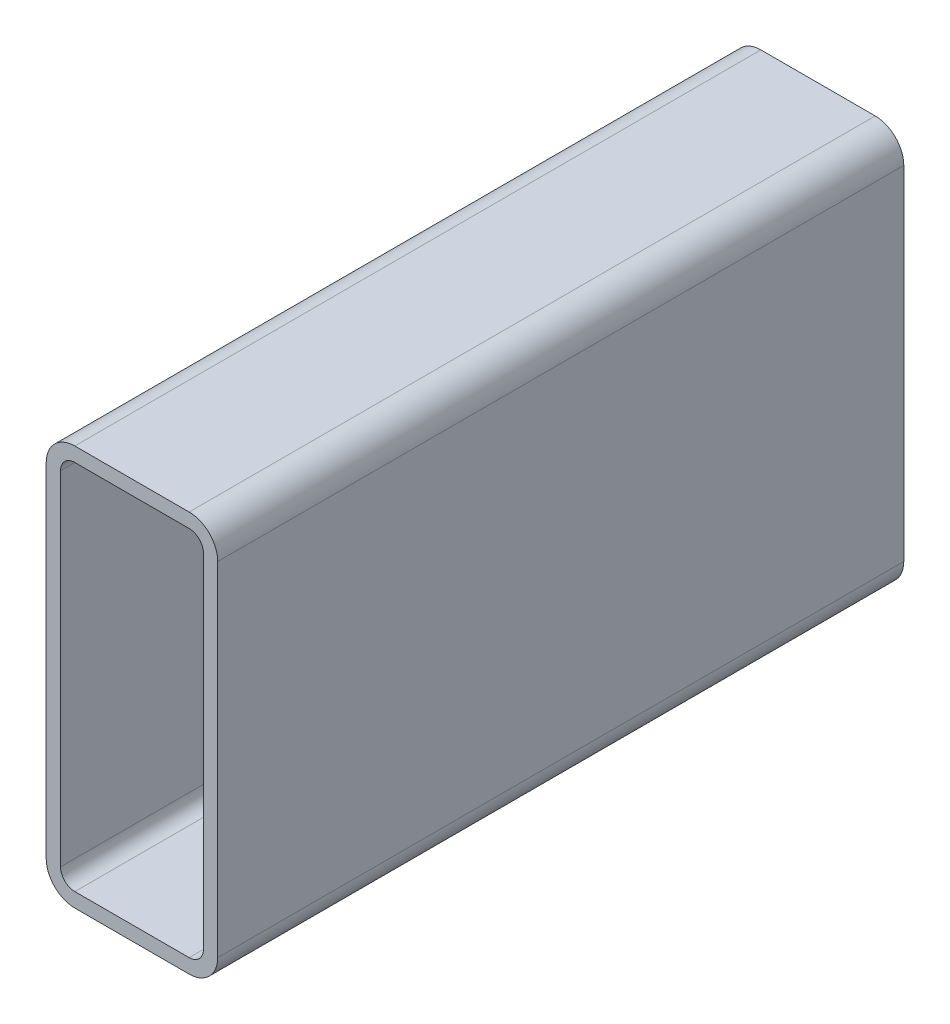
ISO-10303-21;
HEADER;
FILE_DESCRIPTION(('STEP AP214'),'2;1');
FILE_NAME('part.step','',(''),(''),'','','');
FILE_SCHEMA(('AUTOMOTIVE_DESIGN { 1 0 10303 214 1 1 1 1 }'));
ENDSEC;
DATA;
#1=APPLICATION_CONTEXT('core data for automotive mechanical design processes');
#2=APPLICATION_PROTOCOL_DEFINITION('international standard','automotive_design',2000,#1);
#3=PRODUCT_CONTEXT('',#1,'mechanical');
#4=PRODUCT('Part','Part','',(#3));
#5=PRODUCT_RELATED_PRODUCT_CATEGORY('part','',(#4));
#6=PRODUCT_DEFINITION_FORMATION('','',#4);
#7=PRODUCT_DEFINITION_CONTEXT('part definition',#1,'design');
#8=PRODUCT_DEFINITION('design','',#6,#7);
#9=PRODUCT_DEFINITION_SHAPE('','',#8);
#10=(LENGTH_UNIT() NAMED_UNIT(*) SI_UNIT(.MILLI.,.METRE.));
#11=(NAMED_UNIT(*) PLANE_ANGLE_UNIT() SI_UNIT($,.RADIAN.));
#12=(NAMED_UNIT(*) SI_UNIT($,.STERADIAN.) SOLID_ANGLE_UNIT());
#13=UNCERTAINTY_MEASURE_WITH_UNIT(LENGTH_MEASURE(1.E-05),#10,'distance_accuracy_value','');
#14=(GEOMETRIC_REPRESENTATION_CONTEXT(3) GLOBAL_UNCERTAINTY_ASSIGNED_CONTEXT((#13)) GLOBAL_UNIT_ASSIGNED_CONTEXT((#10,
#11,#12)) REPRESENTATION_CONTEXT('',''));
#15=CARTESIAN_POINT('',(0.,0.,0.));
#16=DIRECTION('',(0.,0.,1.));
#17=DIRECTION('',(1.,0.,0.));
#18=AXIS2_PLACEMENT_3D('',#15,#16,#17);
#19=CARTESIAN_POINT('',(15.1891160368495,167.089039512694,304.8));
#20=DIRECTION('',(0.,0.,1.));
#21=DIRECTION('',(1.,0.,0.));
#22=AXIS2_PLACEMENT_3D('',#19,#20,#21);
#23=PLANE('',#22);
#24=CARTESIAN_POINT('',(15.1891160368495,167.089039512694,304.8));
#25=DIRECTION('',(0.,0.,1.));
#26=DIRECTION('',(1.,0.,0.));
#27=AXIS2_PLACEMENT_3D('',#24,#25,#26);
#28=CIRCLE('',#27,12.7);
#29=CARTESIAN_POINT('',(15.1891160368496,179.789039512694,304.8));
#30=VERTEX_POINT('',#29);
#31=CARTESIAN_POINT('',(2.48911603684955,167.089039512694,304.8));
#32=VERTEX_POINT('',#31);
#33=EDGE_CURVE('E211',#30,#32,#28,.T.);
#34=ORIENTED_EDGE('',*,*,#33,.T.);
#35=DIRECTION('',(0.,-1.,0.));
#36=VECTOR('',#35,1.);
#37=CARTESIAN_POINT('',(2.48911603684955,14.6890395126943,304.8));
#38=LINE('',#37,#36);
#39=CARTESIAN_POINT('',(2.48911603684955,14.6890395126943,304.8));
#40=VERTEX_POINT('',#39);
#41=EDGE_CURVE('E214',#32,#40,#38,.T.);
#42=ORIENTED_EDGE('',*,*,#41,.T.);
#43=CARTESIAN_POINT('',(15.1891160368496,14.6890395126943,304.8));
#44=DIRECTION('',(0.,0.,1.));
#45=DIRECTION('',(1.,0.,0.));
#46=AXIS2_PLACEMENT_3D('',#43,#44,#45);
#47=CIRCLE('',#46,12.7);
#48=CARTESIAN_POINT('',(15.1891160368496,1.98903951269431,304.8));
#49=VERTEX_POINT('',#48);
#50=EDGE_CURVE('E217',#40,#49,#47,.T.);
#51=ORIENTED_EDGE('',*,*,#50,.T.);
#52=DIRECTION('',(1.,0.,0.));
#53=VECTOR('',#52,1.);
#54=CARTESIAN_POINT('',(65.9891160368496,1.98903951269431,304.8));
#55=LINE('',#54,#53);
#56=CARTESIAN_POINT('',(65.9891160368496,1.98903951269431,304.8));
#57=VERTEX_POINT('',#56);
#58=EDGE_CURVE('E219',#49,#57,#55,.T.);
#59=ORIENTED_EDGE('',*,*,#58,.T.);
#60=CARTESIAN_POINT('',(65.9891160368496,14.6890395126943,304.8));
#61=DIRECTION('',(0.,0.,1.));
#62=DIRECTION('',(1.,0.,0.));
#63=AXIS2_PLACEMENT_3D('',#60,#61,#62);
#64=CIRCLE('',#63,12.7);
#65=CARTESIAN_POINT('',(78.6891160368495,14.6890395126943,304.8));
#66=VERTEX_POINT('',#65);
#67=EDGE_CURVE('E221',#57,#66,#64,.T.);
#68=ORIENTED_EDGE('',*,*,#67,.T.);
#69=DIRECTION('',(0.,1.,0.));
#70=VECTOR('',#69,1.);
#71=CARTESIAN_POINT('',(78.6891160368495,167.089039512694,304.8));
#72=LINE('',#71,#70);
#73=CARTESIAN_POINT('',(78.6891160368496,167.089039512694,304.8));
#74=VERTEX_POINT('',#73);
#75=EDGE_CURVE('E223',#66,#74,#72,.T.);
#76=ORIENTED_EDGE('',*,*,#75,.T.);
#77=CARTESIAN_POINT('',(65.9891160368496,167.089039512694,304.8));
#78=DIRECTION('',(0.,0.,1.));
#79=DIRECTION('',(1.,0.,0.));
#80=AXIS2_PLACEMENT_3D('',#77,#78,#79);
#81=CIRCLE('',#80,12.7);
#82=CARTESIAN_POINT('',(65.9891160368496,179.789039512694,304.8));
#83=VERTEX_POINT('',#82);
#84=EDGE_CURVE('E225',#74,#83,#81,.T.);
#85=ORIENTED_EDGE('',*,*,#84,.T.);
#86=DIRECTION('',(-1.,0.,0.));
#87=VECTOR('',#86,1.);
#88=CARTESIAN_POINT('',(15.1891160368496,179.789039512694,304.8));
#89=LINE('',#88,#87);
#90=EDGE_CURVE('E227',#83,#30,#89,.T.);
#91=ORIENTED_EDGE('',*,*,#90,.T.);
#92=EDGE_LOOP('',(#34,#42,#51,#59,#68,#76,#85,#91));
#93=FACE_BOUND('',#92,.T.);
#94=DIRECTION('',(0.,-1.,0.));
#95=VECTOR('',#94,1.);
#96=CARTESIAN_POINT('',(8.83911603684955,14.6890395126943,304.8));
#97=LINE('',#96,#95);
#98=CARTESIAN_POINT('',(8.83911603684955,167.089039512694,304.8));
#99=VERTEX_POINT('',#98);
#100=CARTESIAN_POINT('',(8.83911603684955,14.6890395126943,304.8));
#101=VERTEX_POINT('',#100);
#102=EDGE_CURVE('E154',#99,#101,#97,.T.);
#103=ORIENTED_EDGE('',*,*,#102,.F.);
#104=CARTESIAN_POINT('',(15.1891160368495,167.089039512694,304.8));
#105=DIRECTION('',(0.,0.,1.));
#106=DIRECTION('',(1.,0.,0.));
#107=AXIS2_PLACEMENT_3D('',#104,#105,#106);
#108=CIRCLE('',#107,6.35);
#109=CARTESIAN_POINT('',(15.1891160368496,173.439039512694,304.8));
#110=VERTEX_POINT('',#109);
#111=EDGE_CURVE('E146',#110,#99,#108,.T.);
#112=ORIENTED_EDGE('',*,*,#111,.F.);
#113=DIRECTION('',(-1.,0.,0.));
#114=VECTOR('',#113,1.);
#115=CARTESIAN_POINT('',(15.1891160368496,173.439039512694,304.8));
#116=LINE('',#115,#114);
#117=CARTESIAN_POINT('',(65.9891160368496,173.439039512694,304.8));
#118=VERTEX_POINT('',#117);
#119=EDGE_CURVE('E179',#118,#110,#116,.T.);
#120=ORIENTED_EDGE('',*,*,#119,.F.);
#121=CARTESIAN_POINT('',(65.9891160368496,167.089039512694,304.8));
#122=DIRECTION('',(0.,0.,1.));
#123=DIRECTION('',(1.,0.,0.));
#124=AXIS2_PLACEMENT_3D('',#121,#122,#123);
#125=CIRCLE('',#124,6.34999999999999);
#126=CARTESIAN_POINT('',(72.3391160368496,167.089039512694,304.8));
#127=VERTEX_POINT('',#126);
#128=EDGE_CURVE('E177',#127,#118,#125,.T.);
#129=ORIENTED_EDGE('',*,*,#128,.F.);
#130=DIRECTION('',(0.,1.,0.));
#131=VECTOR('',#130,1.);
#132=CARTESIAN_POINT('',(72.3391160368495,167.089039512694,304.8));
#133=LINE('',#132,#131);
#134=CARTESIAN_POINT('',(72.3391160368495,14.6890395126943,304.8));
#135=VERTEX_POINT('',#134);
#136=EDGE_CURVE('E175',#135,#127,#133,.T.);
#137=ORIENTED_EDGE('',*,*,#136,.F.);
#138=CARTESIAN_POINT('',(65.9891160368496,14.6890395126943,304.8));
#139=DIRECTION('',(0.,0.,1.));
#140=DIRECTION('',(1.,0.,0.));
#141=AXIS2_PLACEMENT_3D('',#138,#139,#140);
#142=CIRCLE('',#141,6.35);
#143=CARTESIAN_POINT('',(65.9891160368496,8.33903951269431,304.8));
#144=VERTEX_POINT('',#143);
#145=EDGE_CURVE('E173',#144,#135,#142,.T.);
#146=ORIENTED_EDGE('',*,*,#145,.F.);
#147=DIRECTION('',(1.,0.,0.));
#148=VECTOR('',#147,1.);
#149=CARTESIAN_POINT('',(65.9891160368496,8.33903951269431,304.8));
#150=LINE('',#149,#148);
#151=CARTESIAN_POINT('',(15.1891160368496,8.33903951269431,304.8));
#152=VERTEX_POINT('',#151);
#153=EDGE_CURVE('E169',#152,#144,#150,.T.);
#154=ORIENTED_EDGE('',*,*,#153,.F.);
#155=CARTESIAN_POINT('',(15.1891160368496,14.6890395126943,304.8));
#156=DIRECTION('',(0.,0.,1.));
#157=DIRECTION('',(1.,0.,0.));
#158=AXIS2_PLACEMENT_3D('',#155,#156,#157);
#159=CIRCLE('',#158,6.35);
#160=EDGE_CURVE('E167',#101,#152,#159,.T.);
#161=ORIENTED_EDGE('',*,*,#160,.F.);
#162=EDGE_LOOP('',(#103,#112,#120,#129,#137,#146,#154,#161));
#163=FACE_BOUND('',#162,.T.);
#164=ADVANCED_FACE('F33',(#93,#163),#23,.T.);
#165=CARTESIAN_POINT('',(15.1891160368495,167.089039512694,0.));
#166=DIRECTION('',(0.,0.,1.));
#167=DIRECTION('',(1.,0.,0.));
#168=AXIS2_PLACEMENT_3D('',#165,#166,#167);
#169=PLANE('',#168);
#170=CARTESIAN_POINT('',(15.1891160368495,167.089039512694,0.));
#171=DIRECTION('',(0.,0.,1.));
#172=DIRECTION('',(1.,0.,0.));
#173=AXIS2_PLACEMENT_3D('',#170,#171,#172);
#174=CIRCLE('',#173,12.7);
#175=CARTESIAN_POINT('',(15.1891160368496,179.789039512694,0.));
#176=VERTEX_POINT('',#175);
#177=CARTESIAN_POINT('',(2.48911603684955,167.089039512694,0.));
#178=VERTEX_POINT('',#177);
#179=EDGE_CURVE('E162',#176,#178,#174,.T.);
#180=ORIENTED_EDGE('',*,*,#179,.F.);
#181=DIRECTION('',(-1.,0.,0.));
#182=VECTOR('',#181,1.);
#183=CARTESIAN_POINT('',(15.1891160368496,179.789039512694,0.));
#184=LINE('',#183,#182);
#185=CARTESIAN_POINT('',(65.9891160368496,179.789039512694,0.));
#186=VERTEX_POINT('',#185);
#187=EDGE_CURVE('E215',#186,#176,#184,.T.);
#188=ORIENTED_EDGE('',*,*,#187,.F.);
#189=CARTESIAN_POINT('',(65.9891160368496,167.089039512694,0.));
#190=DIRECTION('',(0.,0.,1.));
#191=DIRECTION('',(1.,0.,0.));
#192=AXIS2_PLACEMENT_3D('',#189,#190,#191);
#193=CIRCLE('',#192,12.7);
#194=CARTESIAN_POINT('',(78.6891160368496,167.089039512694,0.));
#195=VERTEX_POINT('',#194);
#196=EDGE_CURVE('E242',#195,#186,#193,.T.);
#197=ORIENTED_EDGE('',*,*,#196,.F.);
#198=DIRECTION('',(0.,1.,0.));
#199=VECTOR('',#198,1.);
#200=CARTESIAN_POINT('',(78.6891160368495,167.089039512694,0.));
#201=LINE('',#200,#199);
#202=CARTESIAN_POINT('',(78.6891160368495,14.6890395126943,0.));
#203=VERTEX_POINT('',#202);
#204=EDGE_CURVE('E240',#203,#195,#201,.T.);
#205=ORIENTED_EDGE('',*,*,#204,.F.);
#206=CARTESIAN_POINT('',(65.9891160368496,14.6890395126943,0.));
#207=DIRECTION('',(0.,0.,1.));
#208=DIRECTION('',(1.,0.,0.));
#209=AXIS2_PLACEMENT_3D('',#206,#207,#208);
#210=CIRCLE('',#209,12.7);
#211=CARTESIAN_POINT('',(65.9891160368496,1.98903951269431,0.));
#212=VERTEX_POINT('',#211);
#213=EDGE_CURVE('E238',#212,#203,#210,.T.);
#214=ORIENTED_EDGE('',*,*,#213,.F.);
#215=DIRECTION('',(1.,0.,0.));
#216=VECTOR('',#215,1.);
#217=CARTESIAN_POINT('',(65.9891160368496,1.98903951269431,0.));
#218=LINE('',#217,#216);
#219=CARTESIAN_POINT('',(15.1891160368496,1.98903951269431,0.));
#220=VERTEX_POINT('',#219);
#221=EDGE_CURVE('E236',#220,#212,#218,.T.);
#222=ORIENTED_EDGE('',*,*,#221,.F.);
#223=CARTESIAN_POINT('',(15.1891160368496,14.6890395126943,0.));
#224=DIRECTION('',(0.,0.,1.));
#225=DIRECTION('',(1.,0.,0.));
#226=AXIS2_PLACEMENT_3D('',#223,#224,#225);
#227=CIRCLE('',#226,12.7);
#228=CARTESIAN_POINT('',(2.48911603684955,14.6890395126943,0.));
#229=VERTEX_POINT('',#228);
#230=EDGE_CURVE('E234',#229,#220,#227,.T.);
#231=ORIENTED_EDGE('',*,*,#230,.F.);
#232=DIRECTION('',(0.,-1.,0.));
#233=VECTOR('',#232,1.);
#234=CARTESIAN_POINT('',(2.48911603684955,14.6890395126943,0.));
#235=LINE('',#234,#233);
#236=EDGE_CURVE('E232',#178,#229,#235,.T.);
#237=ORIENTED_EDGE('',*,*,#236,.F.);
#238=EDGE_LOOP('',(#180,#188,#197,#205,#214,#222,#231,#237));
#239=FACE_BOUND('',#238,.T.);
#240=CARTESIAN_POINT('',(15.1891160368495,167.089039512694,0.));
#241=DIRECTION('',(0.,0.,1.));
#242=DIRECTION('',(1.,0.,0.));
#243=AXIS2_PLACEMENT_3D('',#240,#241,#242);
#244=CIRCLE('',#243,6.35);
#245=CARTESIAN_POINT('',(15.1891160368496,173.439039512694,0.));
#246=VERTEX_POINT('',#245);
#247=CARTESIAN_POINT('',(8.83911603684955,167.089039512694,0.));
#248=VERTEX_POINT('',#247);
#249=EDGE_CURVE('E56',#246,#248,#244,.T.);
#250=ORIENTED_EDGE('',*,*,#249,.T.);
#251=DIRECTION('',(0.,-1.,0.));
#252=VECTOR('',#251,1.);
#253=CARTESIAN_POINT('',(8.83911603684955,14.6890395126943,0.));
#254=LINE('',#253,#252);
#255=CARTESIAN_POINT('',(8.83911603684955,14.6890395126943,0.));
#256=VERTEX_POINT('',#255);
#257=EDGE_CURVE('E161',#248,#256,#254,.T.);
#258=ORIENTED_EDGE('',*,*,#257,.T.);
#259=CARTESIAN_POINT('',(15.1891160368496,14.6890395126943,0.));
#260=DIRECTION('',(0.,0.,1.));
#261=DIRECTION('',(1.,0.,0.));
#262=AXIS2_PLACEMENT_3D('',#259,#260,#261);
#263=CIRCLE('',#262,6.35);
#264=CARTESIAN_POINT('',(15.1891160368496,8.33903951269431,0.));
#265=VERTEX_POINT('',#264);
#266=EDGE_CURVE('E183',#256,#265,#263,.T.);
#267=ORIENTED_EDGE('',*,*,#266,.T.);
#268=DIRECTION('',(1.,0.,0.));
#269=VECTOR('',#268,1.);
#270=CARTESIAN_POINT('',(65.9891160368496,8.33903951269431,0.));
#271=LINE('',#270,#269);
#272=CARTESIAN_POINT('',(65.9891160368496,8.33903951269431,0.));
#273=VERTEX_POINT('',#272);
#274=EDGE_CURVE('E186',#265,#273,#271,.T.);
#275=ORIENTED_EDGE('',*,*,#274,.T.);
#276=CARTESIAN_POINT('',(65.9891160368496,14.6890395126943,0.));
#277=DIRECTION('',(0.,0.,1.));
#278=DIRECTION('',(1.,0.,0.));
#279=AXIS2_PLACEMENT_3D('',#276,#277,#278);
#280=CIRCLE('',#279,6.35);
#281=CARTESIAN_POINT('',(72.3391160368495,14.6890395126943,0.));
#282=VERTEX_POINT('',#281);
#283=EDGE_CURVE('E189',#273,#282,#280,.T.);
#284=ORIENTED_EDGE('',*,*,#283,.T.);
#285=DIRECTION('',(0.,1.,0.));
#286=VECTOR('',#285,1.);
#287=CARTESIAN_POINT('',(72.3391160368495,167.089039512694,0.));
#288=LINE('',#287,#286);
#289=CARTESIAN_POINT('',(72.3391160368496,167.089039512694,0.));
#290=VERTEX_POINT('',#289);
#291=EDGE_CURVE('E192',#282,#290,#288,.T.);
#292=ORIENTED_EDGE('',*,*,#291,.T.);
#293=CARTESIAN_POINT('',(65.9891160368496,167.089039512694,0.));
#294=DIRECTION('',(0.,0.,1.));
#295=DIRECTION('',(1.,0.,0.));
#296=AXIS2_PLACEMENT_3D('',#293,#294,#295);
#297=CIRCLE('',#296,6.34999999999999);
#298=CARTESIAN_POINT('',(65.9891160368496,173.439039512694,0.));
#299=VERTEX_POINT('',#298);
#300=EDGE_CURVE('E195',#290,#299,#297,.T.);
#301=ORIENTED_EDGE('',*,*,#300,.T.);
#302=DIRECTION('',(-1.,0.,0.));
#303=VECTOR('',#302,1.);
#304=CARTESIAN_POINT('',(15.1891160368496,173.439039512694,0.));
#305=LINE('',#304,#303);
#306=EDGE_CURVE('E155',#299,#246,#305,.T.);
#307=ORIENTED_EDGE('',*,*,#306,.T.);
#308=EDGE_LOOP('',(#250,#258,#267,#275,#284,#292,#301,#307));
#309=FACE_BOUND('',#308,.T.);
#310=ADVANCED_FACE('F272',(#239,#309),#169,.F.);
#311=CARTESIAN_POINT('',(15.1891160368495,167.089039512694,304.8));
#312=DIRECTION('',(0.,0.,-1.));
#313=DIRECTION('',(-1.,0.,0.));
#314=AXIS2_PLACEMENT_3D('',#311,#312,#313);
#315=CYLINDRICAL_SURFACE('',#314,12.7);
#316=ORIENTED_EDGE('',*,*,#179,.T.);
#317=DIRECTION('',(0.,0.,-1.));
#318=VECTOR('',#317,1.);
#319=CARTESIAN_POINT('',(2.48911603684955,167.089039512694,304.8));
#320=LINE('',#319,#318);
#321=EDGE_CURVE('E11',#32,#178,#320,.T.);
#322=ORIENTED_EDGE('',*,*,#321,.F.);
#323=ORIENTED_EDGE('',*,*,#33,.F.);
#324=DIRECTION('',(0.,0.,-1.));
#325=VECTOR('',#324,1.);
#326=CARTESIAN_POINT('',(15.1891160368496,179.789039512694,304.8));
#327=LINE('',#326,#325);
#328=EDGE_CURVE('E229',#30,#176,#327,.T.);
#329=ORIENTED_EDGE('',*,*,#328,.T.);
#330=EDGE_LOOP('',(#316,#322,#323,#329));
#331=FACE_BOUND('',#330,.T.);
#332=ADVANCED_FACE('F35',(#331),#315,.T.);
#333=CARTESIAN_POINT('',(2.48911603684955,14.6890395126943,304.8));
#334=DIRECTION('',(1.,0.,0.));
#335=DIRECTION('',(0.,0.,-1.));
#336=AXIS2_PLACEMENT_3D('',#333,#334,#335);
#337=PLANE('',#336);
#338=ORIENTED_EDGE('',*,*,#236,.T.);
#339=DIRECTION('',(0.,0.,-1.));
#340=VECTOR('',#339,1.);
#341=CARTESIAN_POINT('',(2.48911603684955,14.6890395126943,304.8));
#342=LINE('',#341,#340);
#343=EDGE_CURVE('E41',#40,#229,#342,.T.);
#344=ORIENTED_EDGE('',*,*,#343,.F.);
#345=ORIENTED_EDGE('',*,*,#41,.F.);
#346=ORIENTED_EDGE('',*,*,#321,.T.);
#347=EDGE_LOOP('',(#338,#344,#345,#346));
#348=FACE_BOUND('',#347,.T.);
#349=ADVANCED_FACE('F289',(#348),#337,.F.);
#350=CARTESIAN_POINT('',(15.1891160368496,14.6890395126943,304.8));
#351=DIRECTION('',(0.,0.,-1.));
#352=DIRECTION('',(-1.,0.,0.));
#353=AXIS2_PLACEMENT_3D('',#350,#351,#352);
#354=CYLINDRICAL_SURFACE('',#353,12.7);
#355=ORIENTED_EDGE('',*,*,#230,.T.);
#356=DIRECTION('',(0.,0.,-1.));
#357=VECTOR('',#356,1.);
#358=CARTESIAN_POINT('',(15.1891160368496,1.98903951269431,304.8));
#359=LINE('',#358,#357);
#360=EDGE_CURVE('E259',#49,#220,#359,.T.);
#361=ORIENTED_EDGE('',*,*,#360,.F.);
#362=ORIENTED_EDGE('',*,*,#50,.F.);
#363=ORIENTED_EDGE('',*,*,#343,.T.);
#364=EDGE_LOOP('',(#355,#361,#362,#363));
#365=FACE_BOUND('',#364,.T.);
#366=ADVANCED_FACE('F266',(#365),#354,.T.);
#367=CARTESIAN_POINT('',(65.9891160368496,1.98903951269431,304.8));
#368=DIRECTION('',(0.,1.,0.));
#369=DIRECTION('',(0.,0.,1.));
#370=AXIS2_PLACEMENT_3D('',#367,#368,#369);
#371=PLANE('',#370);
#372=ORIENTED_EDGE('',*,*,#221,.T.);
#373=DIRECTION('',(0.,0.,-1.));
#374=VECTOR('',#373,1.);
#375=CARTESIAN_POINT('',(65.9891160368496,1.98903951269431,304.8));
#376=LINE('',#375,#374);
#377=EDGE_CURVE('E256',#57,#212,#376,.T.);
#378=ORIENTED_EDGE('',*,*,#377,.F.);
#379=ORIENTED_EDGE('',*,*,#58,.F.);
#380=ORIENTED_EDGE('',*,*,#360,.T.);
#381=EDGE_LOOP('',(#372,#378,#379,#380));
#382=FACE_BOUND('',#381,.T.);
#383=ADVANCED_FACE('F278',(#382),#371,.F.);
#384=CARTESIAN_POINT('',(65.9891160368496,14.6890395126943,304.8));
#385=DIRECTION('',(0.,0.,-1.));
#386=DIRECTION('',(-1.,0.,0.));
#387=AXIS2_PLACEMENT_3D('',#384,#385,#386);
#388=CYLINDRICAL_SURFACE('',#387,12.7);
#389=ORIENTED_EDGE('',*,*,#213,.T.);
#390=DIRECTION('',(0.,0.,-1.));
#391=VECTOR('',#390,1.);
#392=CARTESIAN_POINT('',(78.6891160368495,14.6890395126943,304.8));
#393=LINE('',#392,#391);
#394=EDGE_CURVE('E253',#66,#203,#393,.T.);
#395=ORIENTED_EDGE('',*,*,#394,.F.);
#396=ORIENTED_EDGE('',*,*,#67,.F.);
#397=ORIENTED_EDGE('',*,*,#377,.T.);
#398=EDGE_LOOP('',(#389,#395,#396,#397));
#399=FACE_BOUND('',#398,.T.);
#400=ADVANCED_FACE('F282',(#399),#388,.T.);
#401=CARTESIAN_POINT('',(78.6891160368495,167.089039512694,304.8));
#402=DIRECTION('',(-1.,0.,0.));
#403=DIRECTION('',(0.,0.,1.));
#404=AXIS2_PLACEMENT_3D('',#401,#402,#403);
#405=PLANE('',#404);
#406=ORIENTED_EDGE('',*,*,#204,.T.);
#407=DIRECTION('',(0.,0.,-1.));
#408=VECTOR('',#407,1.);
#409=CARTESIAN_POINT('',(78.6891160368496,167.089039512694,304.8));
#410=LINE('',#409,#408);
#411=EDGE_CURVE('E250',#74,#195,#410,.T.);
#412=ORIENTED_EDGE('',*,*,#411,.F.);
#413=ORIENTED_EDGE('',*,*,#75,.F.);
#414=ORIENTED_EDGE('',*,*,#394,.T.);
#415=EDGE_LOOP('',(#406,#412,#413,#414));
#416=FACE_BOUND('',#415,.T.);
#417=ADVANCED_FACE('F302',(#416),#405,.F.);
#418=CARTESIAN_POINT('',(65.9891160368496,167.089039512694,304.8));
#419=DIRECTION('',(0.,0.,-1.));
#420=DIRECTION('',(-1.,0.,0.));
#421=AXIS2_PLACEMENT_3D('',#418,#419,#420);
#422=CYLINDRICAL_SURFACE('',#421,12.7);
#423=ORIENTED_EDGE('',*,*,#196,.T.);
#424=DIRECTION('',(0.,0.,-1.));
#425=VECTOR('',#424,1.);
#426=CARTESIAN_POINT('',(65.9891160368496,179.789039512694,304.8));
#427=LINE('',#426,#425);
#428=EDGE_CURVE('E247',#83,#186,#427,.T.);
#429=ORIENTED_EDGE('',*,*,#428,.F.);
#430=ORIENTED_EDGE('',*,*,#84,.F.);
#431=ORIENTED_EDGE('',*,*,#411,.T.);
#432=EDGE_LOOP('',(#423,#429,#430,#431));
#433=FACE_BOUND('',#432,.T.);
#434=ADVANCED_FACE('F300',(#433),#422,.T.);
#435=CARTESIAN_POINT('',(15.1891160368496,179.789039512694,304.8));
#436=DIRECTION('',(0.,-1.,0.));
#437=DIRECTION('',(0.,0.,-1.));
#438=AXIS2_PLACEMENT_3D('',#435,#436,#437);
#439=PLANE('',#438);
#440=ORIENTED_EDGE('',*,*,#187,.T.);
#441=ORIENTED_EDGE('',*,*,#328,.F.);
#442=ORIENTED_EDGE('',*,*,#90,.F.);
#443=ORIENTED_EDGE('',*,*,#428,.T.);
#444=EDGE_LOOP('',(#440,#441,#442,#443));
#445=FACE_BOUND('',#444,.T.);
#446=ADVANCED_FACE('F295',(#445),#439,.F.);
#447=CARTESIAN_POINT('',(15.1891160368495,167.089039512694,304.8));
#448=DIRECTION('',(0.,0.,-1.));
#449=DIRECTION('',(-1.,0.,0.));
#450=AXIS2_PLACEMENT_3D('',#447,#448,#449);
#451=CYLINDRICAL_SURFACE('',#450,6.35);
#452=ORIENTED_EDGE('',*,*,#249,.F.);
#453=DIRECTION('',(0.,0.,-1.));
#454=VECTOR('',#453,1.);
#455=CARTESIAN_POINT('',(15.1891160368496,173.439039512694,304.8));
#456=LINE('',#455,#454);
#457=EDGE_CURVE('E150',#110,#246,#456,.T.);
#458=ORIENTED_EDGE('',*,*,#457,.F.);
#459=ORIENTED_EDGE('',*,*,#111,.T.);
#460=DIRECTION('',(0.,0.,-1.));
#461=VECTOR('',#460,1.);
#462=CARTESIAN_POINT('',(8.83911603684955,167.089039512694,304.8));
#463=LINE('',#462,#461);
#464=EDGE_CURVE('E149',#99,#248,#463,.T.);
#465=ORIENTED_EDGE('',*,*,#464,.T.);
#466=EDGE_LOOP('',(#452,#458,#459,#465));
#467=FACE_BOUND('',#466,.T.);
#468=ADVANCED_FACE('F148',(#467),#451,.F.);
#469=CARTESIAN_POINT('',(8.83911603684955,14.6890395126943,304.8));
#470=DIRECTION('',(1.,0.,0.));
#471=DIRECTION('',(0.,0.,-1.));
#472=AXIS2_PLACEMENT_3D('',#469,#470,#471);
#473=PLANE('',#472);
#474=ORIENTED_EDGE('',*,*,#257,.F.);
#475=ORIENTED_EDGE('',*,*,#464,.F.);
#476=ORIENTED_EDGE('',*,*,#102,.T.);
#477=DIRECTION('',(0.,0.,-1.));
#478=VECTOR('',#477,1.);
#479=CARTESIAN_POINT('',(8.83911603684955,14.6890395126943,304.8));
#480=LINE('',#479,#478);
#481=EDGE_CURVE('E163',#101,#256,#480,.T.);
#482=ORIENTED_EDGE('',*,*,#481,.T.);
#483=EDGE_LOOP('',(#474,#475,#476,#482));
#484=FACE_BOUND('',#483,.T.);
#485=ADVANCED_FACE('F158',(#484),#473,.T.);
#486=CARTESIAN_POINT('',(15.1891160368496,14.6890395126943,304.8));
#487=DIRECTION('',(0.,0.,-1.));
#488=DIRECTION('',(-1.,0.,0.));
#489=AXIS2_PLACEMENT_3D('',#486,#487,#488);
#490=CYLINDRICAL_SURFACE('',#489,6.35);
#491=ORIENTED_EDGE('',*,*,#266,.F.);
#492=ORIENTED_EDGE('',*,*,#481,.F.);
#493=ORIENTED_EDGE('',*,*,#160,.T.);
#494=DIRECTION('',(0.,0.,-1.));
#495=VECTOR('',#494,1.);
#496=CARTESIAN_POINT('',(15.1891160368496,8.33903951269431,304.8));
#497=LINE('',#496,#495);
#498=EDGE_CURVE('E208',#152,#265,#497,.T.);
#499=ORIENTED_EDGE('',*,*,#498,.T.);
#500=EDGE_LOOP('',(#491,#492,#493,#499));
#501=FACE_BOUND('',#500,.T.);
#502=ADVANCED_FACE('F327',(#501),#490,.F.);
#503=CARTESIAN_POINT('',(65.9891160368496,8.33903951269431,304.8));
#504=DIRECTION('',(0.,1.,0.));
#505=DIRECTION('',(0.,0.,1.));
#506=AXIS2_PLACEMENT_3D('',#503,#504,#505);
#507=PLANE('',#506);
#508=ORIENTED_EDGE('',*,*,#274,.F.);
#509=ORIENTED_EDGE('',*,*,#498,.F.);
#510=ORIENTED_EDGE('',*,*,#153,.T.);
#511=DIRECTION('',(0.,0.,-1.));
#512=VECTOR('',#511,1.);
#513=CARTESIAN_POINT('',(65.9891160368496,8.33903951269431,304.8));
#514=LINE('',#513,#512);
#515=EDGE_CURVE('E206',#144,#273,#514,.T.);
#516=ORIENTED_EDGE('',*,*,#515,.T.);
#517=EDGE_LOOP('',(#508,#509,#510,#516));
#518=FACE_BOUND('',#517,.T.);
#519=ADVANCED_FACE('F331',(#518),#507,.T.);
#520=CARTESIAN_POINT('',(65.9891160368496,14.6890395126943,304.8));
#521=DIRECTION('',(0.,0.,-1.));
#522=DIRECTION('',(-1.,0.,0.));
#523=AXIS2_PLACEMENT_3D('',#520,#521,#522);
#524=CYLINDRICAL_SURFACE('',#523,6.35);
#525=ORIENTED_EDGE('',*,*,#283,.F.);
#526=ORIENTED_EDGE('',*,*,#515,.F.);
#527=ORIENTED_EDGE('',*,*,#145,.T.);
#528=DIRECTION('',(0.,0.,-1.));
#529=VECTOR('',#528,1.);
#530=CARTESIAN_POINT('',(72.3391160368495,14.6890395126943,304.8));
#531=LINE('',#530,#529);
#532=EDGE_CURVE('E204',#135,#282,#531,.T.);
#533=ORIENTED_EDGE('',*,*,#532,.T.);
#534=EDGE_LOOP('',(#525,#526,#527,#533));
#535=FACE_BOUND('',#534,.T.);
#536=ADVANCED_FACE('F337',(#535),#524,.F.);
#537=CARTESIAN_POINT('',(72.3391160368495,167.089039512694,304.8));
#538=DIRECTION('',(-1.,0.,0.));
#539=DIRECTION('',(0.,0.,1.));
#540=AXIS2_PLACEMENT_3D('',#537,#538,#539);
#541=PLANE('',#540);
#542=ORIENTED_EDGE('',*,*,#291,.F.);
#543=ORIENTED_EDGE('',*,*,#532,.F.);
#544=ORIENTED_EDGE('',*,*,#136,.T.);
#545=DIRECTION('',(0.,0.,-1.));
#546=VECTOR('',#545,1.);
#547=CARTESIAN_POINT('',(72.3391160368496,167.089039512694,304.8));
#548=LINE('',#547,#546);
#549=EDGE_CURVE('E202',#127,#290,#548,.T.);
#550=ORIENTED_EDGE('',*,*,#549,.T.);
#551=EDGE_LOOP('',(#542,#543,#544,#550));
#552=FACE_BOUND('',#551,.T.);
#553=ADVANCED_FACE('F341',(#552),#541,.T.);
#554=CARTESIAN_POINT('',(65.9891160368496,167.089039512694,304.8));
#555=DIRECTION('',(0.,0.,-1.));
#556=DIRECTION('',(-1.,0.,0.));
#557=AXIS2_PLACEMENT_3D('',#554,#555,#556);
#558=CYLINDRICAL_SURFACE('',#557,6.34999999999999);
#559=ORIENTED_EDGE('',*,*,#300,.F.);
#560=ORIENTED_EDGE('',*,*,#549,.F.);
#561=ORIENTED_EDGE('',*,*,#128,.T.);
#562=DIRECTION('',(0.,0.,-1.));
#563=VECTOR('',#562,1.);
#564=CARTESIAN_POINT('',(65.9891160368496,173.439039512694,304.8));
#565=LINE('',#564,#563);
#566=EDGE_CURVE('E48',#118,#299,#565,.T.);
#567=ORIENTED_EDGE('',*,*,#566,.T.);
#568=EDGE_LOOP('',(#559,#560,#561,#567));
#569=FACE_BOUND('',#568,.T.);
#570=ADVANCED_FACE('F345',(#569),#558,.F.);
#571=CARTESIAN_POINT('',(15.1891160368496,173.439039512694,304.8));
#572=DIRECTION('',(0.,-1.,0.));
#573=DIRECTION('',(0.,0.,-1.));
#574=AXIS2_PLACEMENT_3D('',#571,#572,#573);
#575=PLANE('',#574);
#576=ORIENTED_EDGE('',*,*,#306,.F.);
#577=ORIENTED_EDGE('',*,*,#566,.F.);
#578=ORIENTED_EDGE('',*,*,#119,.T.);
#579=ORIENTED_EDGE('',*,*,#457,.T.);
#580=EDGE_LOOP('',(#576,#577,#578,#579));
#581=FACE_BOUND('',#580,.T.);
#582=ADVANCED_FACE('F349',(#581),#575,.T.);
#583=CLOSED_SHELL('',(#164,#310,#332,#349,#366,#383,#400,#417,#434,#446,#468,#485,#502,#519,
#536,#553,#570,#582));
#584=MANIFOLD_SOLID_BREP('B2',#583);
#585=ADVANCED_BREP_SHAPE_REPRESENTATION('',(#18,#584),#14);
#586=SHAPE_DEFINITION_REPRESENTATION(#9,#585);
ENDSEC;
END-ISO-10303-21;
